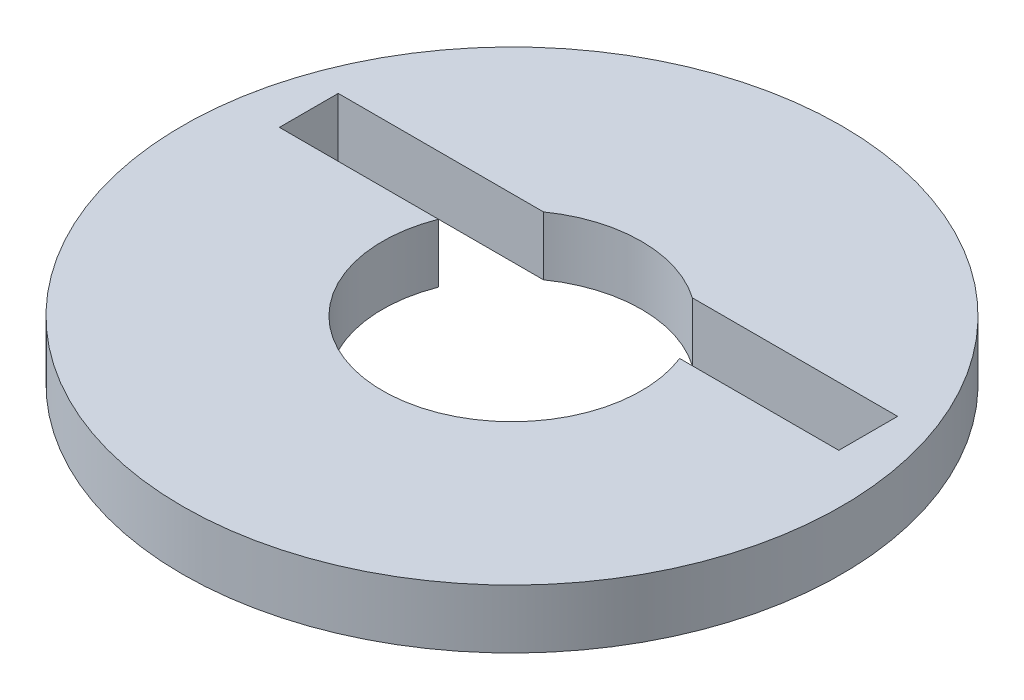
from build123d import *

# Parameters (mm, degrees)
SKETCH1_R           = 17.78
BOSS_EXTRUDE1_DEPTH = 3.175
SKETCH2_W           = 30.17980714
SKETCH2_H           = 3.175
CUT_EXTRUDE1_DEPTH  = 26.344376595
SKETCH3_R           = 6.985
CUT_EXTRUDE2_DEPTH  = 26.344376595


with BuildPart() as part:
    # Sketch1 → Boss-Extrude1 (new body)
    with BuildSketch(Plane(origin=(0, 0, 0), x_dir=(1, 0, 0), z_dir=(0, 1, 0))):
        with Locations(Location((0, 0, 0), (0, 0, 270))):
            Circle(SKETCH1_R)
    extrude(amount=BOSS_EXTRUDE1_DEPTH)

    # Sketch2 → Cut-Extrude1 (cut, through all)
    with BuildSketch(Plane(origin=(0, 3.175, 0), x_dir=(1, 0, 0), z_dir=(0, 1, 0))):
        with Locations((0, 4.1275)):
            Rectangle(SKETCH2_W, SKETCH2_H)
    extrude(amount=-CUT_EXTRUDE1_DEPTH, mode=Mode.SUBTRACT)

    # Sketch3 → Cut-Extrude2 (cut, through all)
    with BuildSketch(Plane(origin=(0, 3.175, 0), x_dir=(1, 0, 0), z_dir=(0, 1, 0))):
        Circle(SKETCH3_R)
    extrude(amount=-CUT_EXTRUDE2_DEPTH, mode=Mode.SUBTRACT)


solid = part.part
